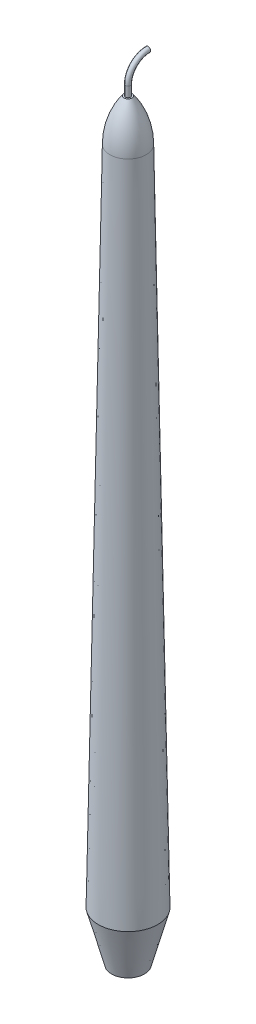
ISO-10303-21;
HEADER;
FILE_DESCRIPTION(('STEP AP214'),'2;1');
FILE_NAME('part.step','',(''),(''),'','','');
FILE_SCHEMA(('AUTOMOTIVE_DESIGN { 1 0 10303 214 1 1 1 1 }'));
ENDSEC;
DATA;
#1=APPLICATION_CONTEXT('core data for automotive mechanical design processes');
#2=APPLICATION_PROTOCOL_DEFINITION('international standard','automotive_design',2000,#1);
#3=PRODUCT_CONTEXT('',#1,'mechanical');
#4=PRODUCT('Part','Part','',(#3));
#5=PRODUCT_RELATED_PRODUCT_CATEGORY('part','',(#4));
#6=PRODUCT_DEFINITION_FORMATION('','',#4);
#7=PRODUCT_DEFINITION_CONTEXT('part definition',#1,'design');
#8=PRODUCT_DEFINITION('design','',#6,#7);
#9=PRODUCT_DEFINITION_SHAPE('','',#8);
#10=(LENGTH_UNIT() NAMED_UNIT(*) SI_UNIT(.MILLI.,.METRE.));
#11=(NAMED_UNIT(*) PLANE_ANGLE_UNIT() SI_UNIT($,.RADIAN.));
#12=(NAMED_UNIT(*) SI_UNIT($,.STERADIAN.) SOLID_ANGLE_UNIT());
#13=UNCERTAINTY_MEASURE_WITH_UNIT(LENGTH_MEASURE(1.E-05),#10,'distance_accuracy_value','');
#14=(GEOMETRIC_REPRESENTATION_CONTEXT(3) GLOBAL_UNCERTAINTY_ASSIGNED_CONTEXT((#13)) GLOBAL_UNIT_ASSIGNED_CONTEXT((#10,
#11,#12)) REPRESENTATION_CONTEXT('',''));
#15=CARTESIAN_POINT('',(0.,0.,0.));
#16=DIRECTION('',(0.,0.,1.));
#17=DIRECTION('',(1.,0.,0.));
#18=AXIS2_PLACEMENT_3D('',#15,#16,#17);
#19=CARTESIAN_POINT('',(0.,380.,0.));
#20=DIRECTION('',(0.,1.,0.));
#21=DIRECTION('',(0.,0.,1.));
#22=AXIS2_PLACEMENT_3D('',#19,#20,#21);
#23=PLANE('',#22);
#24=CARTESIAN_POINT('',(0.,380.,0.));
#25=DIRECTION('',(0.,-1.,0.));
#26=DIRECTION('',(0.,0.,-1.));
#27=AXIS2_PLACEMENT_3D('',#24,#25,#26);
#28=CIRCLE('',#27,2.);
#29=CARTESIAN_POINT('',(0.,380.,-2.));
#30=VERTEX_POINT('',#29);
#31=EDGE_CURVE('E37',#30,#30,#28,.T.);
#32=ORIENTED_EDGE('',*,*,#31,.F.);
#33=EDGE_LOOP('',(#32));
#34=FACE_BOUND('',#33,.T.);
#35=CARTESIAN_POINT('',(0.,380.,0.));
#36=DIRECTION('',(0.,1.,0.));
#37=DIRECTION('',(0.,0.,1.));
#38=AXIS2_PLACEMENT_3D('',#35,#36,#37);
#39=CIRCLE('',#38,1.27);
#40=CARTESIAN_POINT('',(0.,380.,1.27));
#41=VERTEX_POINT('',#40);
#42=EDGE_CURVE('E54',#41,#41,#39,.T.);
#43=ORIENTED_EDGE('',*,*,#42,.F.);
#44=EDGE_LOOP('',(#43));
#45=FACE_BOUND('',#44,.T.);
#46=ADVANCED_FACE('F30',(#34,#45),#23,.T.);
#47=CARTESIAN_POINT('',(0.,25.,0.));
#48=DIRECTION('',(0.,-1.,0.));
#49=DIRECTION('',(0.,0.,-1.));
#50=AXIS2_PLACEMENT_3D('',#47,#48,#49);
#51=CONICAL_SURFACE('',#50,15.,0.0174532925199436);
#52=CARTESIAN_POINT('',(0.,358.769949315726,0.));
#53=DIRECTION('',(0.,-1.,0.));
#54=DIRECTION('',(0.,0.,-1.));
#55=AXIS2_PLACEMENT_3D('',#52,#53,#54);
#56=CIRCLE('',#55,9.17402386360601);
#57=CARTESIAN_POINT('',(0.,358.769949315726,-9.17402386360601));
#58=VERTEX_POINT('',#57);
#59=EDGE_CURVE('E10',#58,#58,#56,.T.);
#60=ORIENTED_EDGE('',*,*,#59,.T.);
#61=EDGE_LOOP('',(#60));
#62=FACE_BOUND('',#61,.T.);
#63=CARTESIAN_POINT('',(0.,25.,0.));
#64=DIRECTION('',(0.,-1.,0.));
#65=DIRECTION('',(0.,0.,-1.));
#66=AXIS2_PLACEMENT_3D('',#63,#64,#65);
#67=CIRCLE('',#66,15.);
#68=CARTESIAN_POINT('',(0.,25.,-15.));
#69=VERTEX_POINT('',#68);
#70=EDGE_CURVE('E45',#69,#69,#67,.T.);
#71=ORIENTED_EDGE('',*,*,#70,.F.);
#72=EDGE_LOOP('',(#71));
#73=FACE_BOUND('',#72,.T.);
#74=ADVANCED_FACE('F32',(#62,#73),#51,.T.);
#75=CARTESIAN_POINT('',(0.,358.769949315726,0.));
#76=DIRECTION('',(0.,-1.,0.));
#77=DIRECTION('',(0.,0.,-1.));
#78=AXIS2_PLACEMENT_3D('',#75,#76,#77);
#79=DEGENERATE_TOROIDAL_SURFACE('',#78,25.825976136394,35.,.F.);
#80=ORIENTED_EDGE('',*,*,#31,.T.);
#81=EDGE_LOOP('',(#80));
#82=FACE_BOUND('',#81,.T.);
#83=ORIENTED_EDGE('',*,*,#59,.F.);
#84=EDGE_LOOP('',(#83));
#85=FACE_BOUND('',#84,.T.);
#86=ADVANCED_FACE('F76',(#82,#85),#79,.F.);
#87=CARTESIAN_POINT('',(8.30127018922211,0.,0.));
#88=DIRECTION('',(0.,-1.,0.));
#89=DIRECTION('',(0.,0.,-1.));
#90=AXIS2_PLACEMENT_3D('',#87,#88,#89);
#91=PLANE('',#90);
#92=CARTESIAN_POINT('',(0.,0.,0.));
#93=DIRECTION('',(0.,-1.,0.));
#94=DIRECTION('',(0.,0.,-1.));
#95=AXIS2_PLACEMENT_3D('',#92,#93,#94);
#96=CIRCLE('',#95,8.30127018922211);
#97=CARTESIAN_POINT('',(0.,0.,-8.30127018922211));
#98=VERTEX_POINT('',#97);
#99=EDGE_CURVE('E41',#98,#98,#96,.T.);
#100=ORIENTED_EDGE('',*,*,#99,.T.);
#101=EDGE_LOOP('',(#100));
#102=FACE_BOUND('',#101,.T.);
#103=ADVANCED_FACE('F78',(#102),#91,.T.);
#104=CARTESIAN_POINT('',(0.,0.,0.));
#105=DIRECTION('',(0.,1.,0.));
#106=DIRECTION('',(0.,0.,1.));
#107=AXIS2_PLACEMENT_3D('',#104,#105,#106);
#108=CONICAL_SURFACE('',#107,8.30127018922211,0.261799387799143);
#109=ORIENTED_EDGE('',*,*,#70,.T.);
#110=EDGE_LOOP('',(#109));
#111=FACE_BOUND('',#110,.T.);
#112=ORIENTED_EDGE('',*,*,#99,.F.);
#113=EDGE_LOOP('',(#112));
#114=FACE_BOUND('',#113,.T.);
#115=ADVANCED_FACE('F84',(#111,#114),#108,.T.);
#116=CARTESIAN_POINT('',(0.,385.08,-10.16));
#117=DIRECTION('',(-1.,0.,0.));
#118=DIRECTION('',(0.,0.,1.));
#119=AXIS2_PLACEMENT_3D('',#116,#117,#118);
#120=TOROIDAL_SURFACE('',#119,10.16,1.27);
#121=CARTESIAN_POINT('',(0.,385.08,0.));
#122=DIRECTION('',(0.,1.,0.));
#123=DIRECTION('',(0.,0.,1.));
#124=AXIS2_PLACEMENT_3D('',#121,#122,#123);
#125=CIRCLE('',#124,1.27);
#126=CARTESIAN_POINT('',(0.,385.08,1.27));
#127=VERTEX_POINT('',#126);
#128=EDGE_CURVE('E53',#127,#127,#125,.T.);
#129=CARTESIAN_POINT('',(0.,395.24,-10.1600000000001));
#130=DIRECTION('',(0.,0.,-1.));
#131=DIRECTION('',(0.,1.,0.));
#132=AXIS2_PLACEMENT_3D('',#129,#130,#131);
#133=CIRCLE('',#132,1.27);
#134=CARTESIAN_POINT('',(0.,396.51,-10.1600000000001));
#135=VERTEX_POINT('',#134);
#136=EDGE_CURVE('E50',#135,#135,#133,.T.);
#137=CARTESIAN_POINT('',(0.,385.08,-10.16));
#138=DIRECTION('',(-1.,0.,0.));
#139=DIRECTION('',(0.,0.,1.));
#140=AXIS2_PLACEMENT_3D('',#137,#138,#139);
#141=CIRCLE('',#140,11.43);
#142=EDGE_CURVE('',#127,#135,#141,.T.);
#143=ORIENTED_EDGE('',*,*,#128,.T.);
#144=ORIENTED_EDGE('',*,*,#136,.F.);
#145=ORIENTED_EDGE('',*,*,#142,.T.);
#146=ORIENTED_EDGE('',*,*,#142,.F.);
#147=EDGE_LOOP('',(#143,#145,#144,#146));
#148=FACE_BOUND('',#147,.T.);
#149=ADVANCED_FACE('F60',(#148),#120,.T.);
#150=CARTESIAN_POINT('',(0.,385.08,0.));
#151=DIRECTION('',(0.,-1.,0.));
#152=DIRECTION('',(0.,0.,-1.));
#153=AXIS2_PLACEMENT_3D('',#150,#151,#152);
#154=CYLINDRICAL_SURFACE('',#153,1.27);
#155=ORIENTED_EDGE('',*,*,#128,.F.);
#156=EDGE_LOOP('',(#155));
#157=FACE_BOUND('',#156,.T.);
#158=ORIENTED_EDGE('',*,*,#42,.T.);
#159=EDGE_LOOP('',(#158));
#160=FACE_BOUND('',#159,.T.);
#161=ADVANCED_FACE('F63',(#157,#160),#154,.T.);
#162=CARTESIAN_POINT('',(0.,395.24,-10.1600000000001));
#163=DIRECTION('',(0.,0.,-1.));
#164=DIRECTION('',(0.,1.,0.));
#165=AXIS2_PLACEMENT_3D('',#162,#163,#164);
#166=PLANE('',#165);
#167=ORIENTED_EDGE('',*,*,#136,.T.);
#168=EDGE_LOOP('',(#167));
#169=FACE_BOUND('',#168,.T.);
#170=ADVANCED_FACE('F66',(#169),#166,.T.);
#171=CLOSED_SHELL('',(#46,#74,#86,#103,#115,#149,#161,#170));
#172=MANIFOLD_SOLID_BREP('B2',#171);
#173=ADVANCED_BREP_SHAPE_REPRESENTATION('',(#18,#172),#14);
#174=SHAPE_DEFINITION_REPRESENTATION(#9,#173);
ENDSEC;
END-ISO-10303-21;
